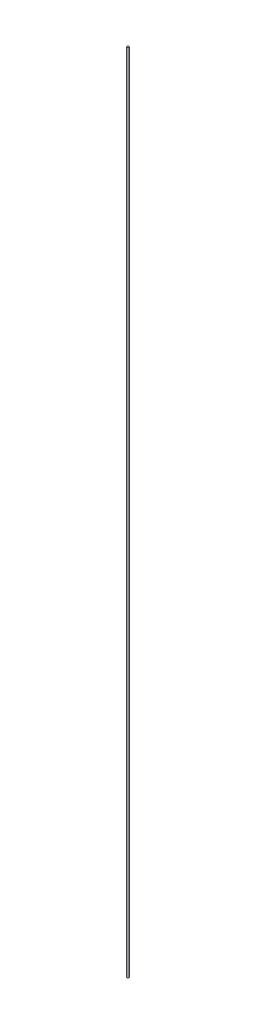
ISO-10303-21;
HEADER;
FILE_DESCRIPTION(('STEP AP214'),'2;1');
FILE_NAME('part.step','',(''),(''),'','','');
FILE_SCHEMA(('AUTOMOTIVE_DESIGN { 1 0 10303 214 1 1 1 1 }'));
ENDSEC;
DATA;
#1=APPLICATION_CONTEXT('core data for automotive mechanical design processes');
#2=APPLICATION_PROTOCOL_DEFINITION('international standard','automotive_design',2000,#1);
#3=PRODUCT_CONTEXT('',#1,'mechanical');
#4=PRODUCT('Part','Part','',(#3));
#5=PRODUCT_RELATED_PRODUCT_CATEGORY('part','',(#4));
#6=PRODUCT_DEFINITION_FORMATION('','',#4);
#7=PRODUCT_DEFINITION_CONTEXT('part definition',#1,'design');
#8=PRODUCT_DEFINITION('design','',#6,#7);
#9=PRODUCT_DEFINITION_SHAPE('','',#8);
#10=(LENGTH_UNIT() NAMED_UNIT(*) SI_UNIT(.MILLI.,.METRE.));
#11=(NAMED_UNIT(*) PLANE_ANGLE_UNIT() SI_UNIT($,.RADIAN.));
#12=(NAMED_UNIT(*) SI_UNIT($,.STERADIAN.) SOLID_ANGLE_UNIT());
#13=UNCERTAINTY_MEASURE_WITH_UNIT(LENGTH_MEASURE(1.E-05),#10,'distance_accuracy_value','');
#14=(GEOMETRIC_REPRESENTATION_CONTEXT(3) GLOBAL_UNCERTAINTY_ASSIGNED_CONTEXT((#13)) GLOBAL_UNIT_ASSIGNED_CONTEXT((#10,
#11,#12)) REPRESENTATION_CONTEXT('',''));
#15=CARTESIAN_POINT('',(0.,0.,0.));
#16=DIRECTION('',(0.,0.,1.));
#17=DIRECTION('',(1.,0.,0.));
#18=AXIS2_PLACEMENT_3D('',#15,#16,#17);
#19=CARTESIAN_POINT('',(0.,197.,0.));
#20=DIRECTION('',(0.,-1.,0.));
#21=DIRECTION('',(0.,0.,-1.));
#22=AXIS2_PLACEMENT_3D('',#19,#20,#21);
#23=CYLINDRICAL_SURFACE('',#22,0.25);
#24=CARTESIAN_POINT('',(0.,197.,0.));
#25=DIRECTION('',(0.,1.,0.));
#26=DIRECTION('',(0.,0.,1.));
#27=AXIS2_PLACEMENT_3D('',#24,#25,#26);
#28=CIRCLE('',#27,0.25);
#29=CARTESIAN_POINT('',(0.,197.,0.25));
#30=VERTEX_POINT('',#29);
#31=EDGE_CURVE('E10',#30,#30,#28,.T.);
#32=ORIENTED_EDGE('',*,*,#31,.F.);
#33=EDGE_LOOP('',(#32));
#34=FACE_BOUND('',#33,.T.);
#35=CARTESIAN_POINT('',(0.,0.,0.));
#36=DIRECTION('',(0.,1.,0.));
#37=DIRECTION('',(0.,0.,1.));
#38=AXIS2_PLACEMENT_3D('',#35,#36,#37);
#39=CIRCLE('',#38,0.25);
#40=CARTESIAN_POINT('',(0.,0.,0.25));
#41=VERTEX_POINT('',#40);
#42=EDGE_CURVE('E34',#41,#41,#39,.T.);
#43=ORIENTED_EDGE('',*,*,#42,.T.);
#44=EDGE_LOOP('',(#43));
#45=FACE_BOUND('',#44,.T.);
#46=ADVANCED_FACE('F31',(#34,#45),#23,.T.);
#47=CARTESIAN_POINT('',(0.,197.,0.));
#48=DIRECTION('',(0.,1.,0.));
#49=DIRECTION('',(0.,0.,1.));
#50=AXIS2_PLACEMENT_3D('',#47,#48,#49);
#51=PLANE('',#50);
#52=ORIENTED_EDGE('',*,*,#31,.T.);
#53=EDGE_LOOP('',(#52));
#54=FACE_BOUND('',#53,.T.);
#55=ADVANCED_FACE('F46',(#54),#51,.T.);
#56=CARTESIAN_POINT('',(0.,0.,0.));
#57=DIRECTION('',(0.,1.,0.));
#58=DIRECTION('',(0.,0.,1.));
#59=AXIS2_PLACEMENT_3D('',#56,#57,#58);
#60=PLANE('',#59);
#61=ORIENTED_EDGE('',*,*,#42,.F.);
#62=EDGE_LOOP('',(#61));
#63=FACE_BOUND('',#62,.T.);
#64=ADVANCED_FACE('F44',(#63),#60,.F.);
#65=CLOSED_SHELL('',(#46,#55,#64));
#66=MANIFOLD_SOLID_BREP('B2',#65);
#67=ADVANCED_BREP_SHAPE_REPRESENTATION('',(#18,#66),#14);
#68=SHAPE_DEFINITION_REPRESENTATION(#9,#67);
ENDSEC;
END-ISO-10303-21;
